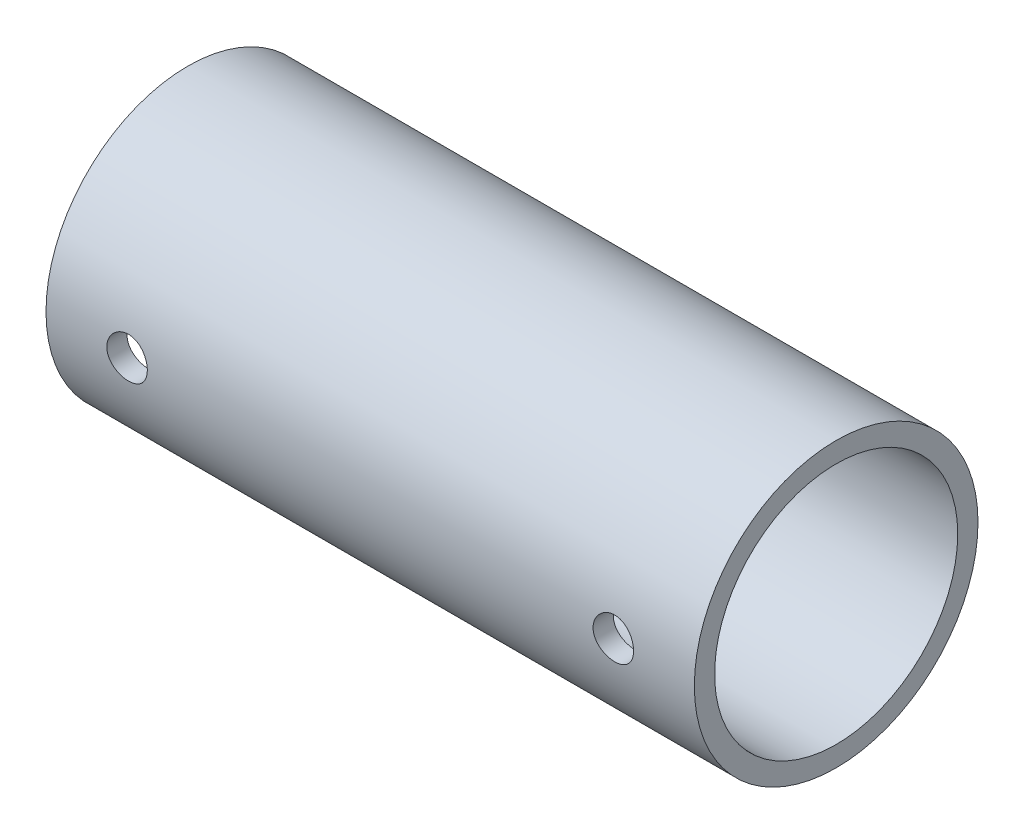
ISO-10303-21;
HEADER;
FILE_DESCRIPTION(('STEP AP214'),'2;1');
FILE_NAME('part.step','',(''),(''),'','','');
FILE_SCHEMA(('AUTOMOTIVE_DESIGN { 1 0 10303 214 1 1 1 1 }'));
ENDSEC;
DATA;
#1=APPLICATION_CONTEXT('core data for automotive mechanical design processes');
#2=APPLICATION_PROTOCOL_DEFINITION('international standard','automotive_design',2000,#1);
#3=PRODUCT_CONTEXT('',#1,'mechanical');
#4=PRODUCT('Part','Part','',(#3));
#5=PRODUCT_RELATED_PRODUCT_CATEGORY('part','',(#4));
#6=PRODUCT_DEFINITION_FORMATION('','',#4);
#7=PRODUCT_DEFINITION_CONTEXT('part definition',#1,'design');
#8=PRODUCT_DEFINITION('design','',#6,#7);
#9=PRODUCT_DEFINITION_SHAPE('','',#8);
#10=(LENGTH_UNIT() NAMED_UNIT(*) SI_UNIT(.MILLI.,.METRE.));
#11=(NAMED_UNIT(*) PLANE_ANGLE_UNIT() SI_UNIT($,.RADIAN.));
#12=(NAMED_UNIT(*) SI_UNIT($,.STERADIAN.) SOLID_ANGLE_UNIT());
#13=UNCERTAINTY_MEASURE_WITH_UNIT(LENGTH_MEASURE(1.E-05),#10,'distance_accuracy_value','');
#14=(GEOMETRIC_REPRESENTATION_CONTEXT(3) GLOBAL_UNCERTAINTY_ASSIGNED_CONTEXT((#13)) GLOBAL_UNIT_ASSIGNED_CONTEXT((#10,
#11,#12)) REPRESENTATION_CONTEXT('',''));
#15=CARTESIAN_POINT('',(0.,0.,0.));
#16=DIRECTION('',(0.,0.,1.));
#17=DIRECTION('',(1.,0.,0.));
#18=AXIS2_PLACEMENT_3D('',#15,#16,#17);
#19=CARTESIAN_POINT('',(203.2,0.,0.));
#20=DIRECTION('',(-1.,0.,0.));
#21=DIRECTION('',(0.,0.,1.));
#22=AXIS2_PLACEMENT_3D('',#19,#20,#21);
#23=CYLINDRICAL_SURFACE('',#22,38.1);
#24=CARTESIAN_POINT('',(184.15,0.,38.1));
#25=CARTESIAN_POINT('',(184.150002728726,-0.177087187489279,38.1000011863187));
#26=CARTESIAN_POINT('',(184.142589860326,-0.354137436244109,38.0987630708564));
#27=CARTESIAN_POINT('',(184.112999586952,-0.707020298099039,38.0938477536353));
#28=CARTESIAN_POINT('',(184.090819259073,-0.88285266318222,38.0901700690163));
#29=CARTESIAN_POINT('',(184.031840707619,-1.23209116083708,38.0804739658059));
#30=CARTESIAN_POINT('',(183.995033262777,-1.40549569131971,38.0744540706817));
#31=CARTESIAN_POINT('',(183.907066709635,-1.74860263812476,38.0602401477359));
#32=CARTESIAN_POINT('',(183.855902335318,-1.91830367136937,38.0520453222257));
#33=CARTESIAN_POINT('',(183.739682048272,-2.25254220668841,38.0337223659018));
#34=CARTESIAN_POINT('',(183.674642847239,-2.41708564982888,38.0235965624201));
#35=CARTESIAN_POINT('',(183.531088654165,-2.74014193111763,38.0016821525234));
#36=CARTESIAN_POINT('',(183.452568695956,-2.89865252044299,37.98989293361));
#37=CARTESIAN_POINT('',(183.282677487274,-3.20841653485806,37.9649864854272));
#38=CARTESIAN_POINT('',(183.191312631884,-3.35967352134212,37.9518699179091));
#39=CARTESIAN_POINT('',(182.996310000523,-3.65404496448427,37.9246597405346));
#40=CARTESIAN_POINT('',(182.892667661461,-3.79715636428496,37.9105657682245));
#41=CARTESIAN_POINT('',(182.672957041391,-4.07534808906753,37.8816744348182));
#42=CARTESIAN_POINT('',(182.55679392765,-4.21035302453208,37.8668722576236));
#43=CARTESIAN_POINT('',(182.313509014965,-4.4701701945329,37.8370808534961));
#44=CARTESIAN_POINT('',(182.186383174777,-4.59497863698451,37.822091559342));
#45=CARTESIAN_POINT('',(181.922122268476,-4.83345363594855,37.7923559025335));
#46=CARTESIAN_POINT('',(181.784990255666,-4.94712356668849,37.7776094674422));
#47=CARTESIAN_POINT('',(181.501568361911,-5.16261513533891,37.7487646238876));
#48=CARTESIAN_POINT('',(181.355275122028,-5.26443238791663,37.7346664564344));
#49=CARTESIAN_POINT('',(181.053703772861,-5.45600638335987,37.7074450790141));
#50=CARTESIAN_POINT('',(180.898378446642,-5.54568970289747,37.6943280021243));
#51=CARTESIAN_POINT('',(180.580551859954,-5.71167137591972,37.6695348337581));
#52=CARTESIAN_POINT('',(180.418047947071,-5.78796472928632,37.6578592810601));
#53=CARTESIAN_POINT('',(180.087118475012,-5.92652810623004,37.6363015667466));
#54=CARTESIAN_POINT('',(179.918695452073,-5.9888040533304,37.6264186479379));
#55=CARTESIAN_POINT('',(179.577069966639,-6.09891747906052,37.6087259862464));
#56=CARTESIAN_POINT('',(179.403865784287,-6.14674968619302,37.600917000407));
#57=CARTESIAN_POINT('',(178.882292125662,-6.26716384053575,37.581106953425));
#58=CARTESIAN_POINT('',(178.52851154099,-6.31810213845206,37.5724910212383));
#59=CARTESIAN_POINT('',(177.817521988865,-6.35996687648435,37.5654259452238));
#60=CARTESIAN_POINT('',(177.460313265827,-6.35089756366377,37.5669760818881));
#61=CARTESIAN_POINT('',(176.756257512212,-6.27352869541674,37.5799723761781));
#62=CARTESIAN_POINT('',(176.409341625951,-6.20584069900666,37.5913163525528));
#63=CARTESIAN_POINT('',(175.731874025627,-6.01409427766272,37.6224668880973));
#64=CARTESIAN_POINT('',(175.401322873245,-5.89003391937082,37.6422737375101));
#65=CARTESIAN_POINT('',(174.764119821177,-5.58844985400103,37.6882274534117));
#66=CARTESIAN_POINT('',(174.457590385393,-5.41067212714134,37.7144043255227));
#67=CARTESIAN_POINT('',(173.878482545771,-5.00687861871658,37.7701281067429));
#68=CARTESIAN_POINT('',(173.605906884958,-4.78085894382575,37.7996752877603));
#69=CARTESIAN_POINT('',(173.098901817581,-4.28366479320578,37.8592595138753));
#70=CARTESIAN_POINT('',(172.86498698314,-4.01196546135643,37.8892980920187));
#71=CARTESIAN_POINT('',(172.445990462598,-3.43289953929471,37.946142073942));
#72=CARTESIAN_POINT('',(172.260909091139,-3.12553271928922,37.9729474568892));
#73=CARTESIAN_POINT('',(171.944786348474,-2.48337302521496,38.0203428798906));
#74=CARTESIAN_POINT('',(171.813790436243,-2.14855736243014,38.0409276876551));
#75=CARTESIAN_POINT('',(171.610034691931,-1.46125779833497,38.0735205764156));
#76=CARTESIAN_POINT('',(171.53726998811,-1.10877537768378,38.0855293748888));
#77=CARTESIAN_POINT('',(171.452739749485,-0.400583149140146,38.0995206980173));
#78=CARTESIAN_POINT('',(171.440267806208,-0.0449598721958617,38.1016193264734));
#79=CARTESIAN_POINT('',(171.474793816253,0.663295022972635,38.0958718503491));
#80=CARTESIAN_POINT('',(171.521789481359,1.015926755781,38.0880261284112));
#81=CARTESIAN_POINT('',(171.673329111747,1.70600668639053,38.063343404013));
#82=CARTESIAN_POINT('',(171.777523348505,2.0435338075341,38.0465610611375));
#83=CARTESIAN_POINT('',(172.040129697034,2.6963290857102,38.0058793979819));
#84=CARTESIAN_POINT('',(172.198544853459,3.01159599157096,37.9819796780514));
#85=CARTESIAN_POINT('',(172.566713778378,3.61398995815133,37.9294267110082));
#86=CARTESIAN_POINT('',(172.77690880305,3.90084376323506,37.9007333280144));
#87=CARTESIAN_POINT('',(173.242065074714,4.43545868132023,37.8418970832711));
#88=CARTESIAN_POINT('',(173.497029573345,4.68321695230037,37.8117541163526));
#89=CARTESIAN_POINT('',(174.047650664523,5.13522675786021,37.7530404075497));
#90=CARTESIAN_POINT('',(174.343701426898,5.33900101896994,37.7244891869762));
#91=CARTESIAN_POINT('',(174.966260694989,5.69392350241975,37.6725570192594));
#92=CARTESIAN_POINT('',(175.292768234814,5.8450733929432,37.6491759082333));
#93=CARTESIAN_POINT('',(175.965570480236,6.08974872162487,37.6103751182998));
#94=CARTESIAN_POINT('',(176.311777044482,6.18351170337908,37.5949226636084));
#95=CARTESIAN_POINT('',(177.015502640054,6.31147698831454,37.5736562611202));
#96=CARTESIAN_POINT('',(177.373020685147,6.34568446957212,37.5678414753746));
#97=CARTESIAN_POINT('',(177.907200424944,6.35156479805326,37.566839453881));
#98=CARTESIAN_POINT('',(178.083891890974,6.34611349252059,37.5677648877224));
#99=CARTESIAN_POINT('',(178.436158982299,6.32051614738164,37.5720813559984));
#100=CARTESIAN_POINT('',(178.611735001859,6.30037562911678,37.5754714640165));
#101=CARTESIAN_POINT('',(178.960586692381,6.24553793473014,37.5846246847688));
#102=CARTESIAN_POINT('',(179.133861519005,6.21083556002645,37.5903886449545));
#103=CARTESIAN_POINT('',(179.476776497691,6.1271569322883,37.604118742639));
#104=CARTESIAN_POINT('',(179.646417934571,6.07818581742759,37.6120840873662));
#105=CARTESIAN_POINT('',(179.980804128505,5.96637654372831,37.6299820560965));
#106=CARTESIAN_POINT('',(180.145552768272,5.90354973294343,37.6399130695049));
#107=CARTESIAN_POINT('',(180.469106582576,5.76449173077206,37.6614601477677));
#108=CARTESIAN_POINT('',(180.627913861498,5.68826534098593,37.6730756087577));
#109=CARTESIAN_POINT('',(180.938629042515,5.52290613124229,37.6976722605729));
#110=CARTESIAN_POINT('',(181.090534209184,5.4337682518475,37.7106539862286));
#111=CARTESIAN_POINT('',(181.386304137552,5.24326758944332,37.7376124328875));
#112=CARTESIAN_POINT('',(181.530171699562,5.14190910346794,37.7515888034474));
#113=CARTESIAN_POINT('',(181.810671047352,4.92632600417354,37.7803292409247));
#114=CARTESIAN_POINT('',(181.947192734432,4.81195911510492,37.7951008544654));
#115=CARTESIAN_POINT('',(182.210092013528,4.5722232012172,37.824851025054));
#116=CARTESIAN_POINT('',(182.336473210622,4.44685811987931,37.8398295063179));
#117=CARTESIAN_POINT('',(182.578352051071,4.18587205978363,37.869588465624));
#118=CARTESIAN_POINT('',(182.69384315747,4.0502450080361,37.8843688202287));
#119=CARTESIAN_POINT('',(182.913014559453,3.76978048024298,37.9133039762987));
#120=CARTESIAN_POINT('',(183.016699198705,3.62494642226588,37.9274590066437));
#121=CARTESIAN_POINT('',(183.212289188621,3.32592456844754,37.9548537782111));
#122=CARTESIAN_POINT('',(183.304103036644,3.17167621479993,37.9680860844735));
#123=CARTESIAN_POINT('',(183.474355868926,2.85593164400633,37.9931404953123));
#124=CARTESIAN_POINT('',(183.552799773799,2.69443812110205,38.0049631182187));
#125=CARTESIAN_POINT('',(183.69572189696,2.36539813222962,38.026859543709));
#126=CARTESIAN_POINT('',(183.760209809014,2.19785596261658,38.0369345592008));
#127=CARTESIAN_POINT('',(183.874784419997,1.85787010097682,38.05505638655));
#128=CARTESIAN_POINT('',(183.924874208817,1.68542746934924,38.0631036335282));
#129=CARTESIAN_POINT('',(184.028052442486,1.26427501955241,38.0798175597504));
#130=CARTESIAN_POINT('',(184.07372844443,1.01366559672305,38.0873506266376));
#131=CARTESIAN_POINT('',(184.134700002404,0.508678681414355,38.0974409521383));
#132=CARTESIAN_POINT('',(184.149996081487,0.254301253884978,38.0999982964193));
#133=CARTESIAN_POINT('',(184.15,0.,38.1));
#134=B_SPLINE_CURVE_WITH_KNOTS('',3,(#24,#25,#26,#27,#28,#29,#30,#31,#32,#33,#34,#35,#36,#37,
#38,#39,#40,#41,#42,#43,#44,#45,#46,#47,#48,#49,#50,#51,#52,#53,#54,#55,#56,#57,#58,#59,#60,#61,
#62,#63,#64,#65,#66,#67,#68,#69,#70,#71,#72,#73,#74,#75,#76,#77,#78,#79,#80,#81,#82,#83,#84,#85,
#86,#87,#88,#89,#90,#91,#92,#93,#94,#95,#96,#97,#98,#99,#100,#101,#102,#103,#104,#105,#106,#107,
#108,#109,#110,#111,#112,#113,#114,#115,#116,#117,#118,#119,#120,#121,#122,#123,#124,#125,#126,
#127,#128,#129,#130,#131,#132,#133),.UNSPECIFIED.,.T.,.F.,(4,2,2,2,2,2,2,2,2,2,2,2,2,2,2,2,2,2,
2,2,2,2,2,2,2,2,2,2,2,2,2,2,2,2,2,2,2,2,2,2,2,2,2,2,2,2,2,2,2,2,2,2,2,2,4),(0.,
0.531038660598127,1.06218246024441,1.59366163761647,2.12533601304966,2.65637358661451,
3.1876072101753,3.71857727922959,4.24974531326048,4.78526441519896,5.32098177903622,
5.85653635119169,6.39228844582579,6.93114981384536,7.47021197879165,8.00904591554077,
8.54807627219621,9.61504645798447,10.6819411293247,11.7378373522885,12.7937697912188,
13.8547758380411,14.9158675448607,15.9901084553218,17.0643562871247,18.1395051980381,
19.2145641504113,20.2769963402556,21.339387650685,22.3953543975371,23.4513804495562,
24.5167374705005,25.5821719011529,26.6586431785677,27.7350803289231,28.807031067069,
29.8788885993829,30.4087059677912,30.9383242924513,31.4681318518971,31.9977488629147,
32.5269337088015,33.0559293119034,33.5851327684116,34.1141506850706,34.6496427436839,
35.1849435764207,35.720563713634,36.2559861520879,36.7953167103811,37.3344483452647,
37.8732042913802,38.4118445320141,39.1744413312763,39.9370250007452),.UNSPECIFIED.);
#135=CARTESIAN_POINT('',(184.15,0.,38.1));
#136=VERTEX_POINT('',#135);
#137=EDGE_CURVE('E82',#136,#136,#134,.T.);
#138=ORIENTED_EDGE('',*,*,#137,.F.);
#139=EDGE_LOOP('',(#138));
#140=FACE_BOUND('',#139,.T.);
#141=CARTESIAN_POINT('',(31.75,0.,38.1));
#142=CARTESIAN_POINT('',(31.7500027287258,-0.177087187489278,38.1000011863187));
#143=CARTESIAN_POINT('',(31.7425898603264,-0.354137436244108,38.0987630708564));
#144=CARTESIAN_POINT('',(31.7129995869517,-0.707020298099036,38.0938477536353));
#145=CARTESIAN_POINT('',(31.6908192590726,-0.882852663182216,38.0901700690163));
#146=CARTESIAN_POINT('',(31.6318407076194,-1.23209116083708,38.0804739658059));
#147=CARTESIAN_POINT('',(31.595033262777,-1.40549569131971,38.0744540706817));
#148=CARTESIAN_POINT('',(31.5070667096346,-1.74860263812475,38.0602401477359));
#149=CARTESIAN_POINT('',(31.4559023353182,-1.91830367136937,38.0520453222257));
#150=CARTESIAN_POINT('',(31.3396820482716,-2.25254220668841,38.0337223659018));
#151=CARTESIAN_POINT('',(31.2746428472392,-2.41708564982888,38.0235965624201));
#152=CARTESIAN_POINT('',(31.131088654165,-2.74014193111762,38.0016821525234));
#153=CARTESIAN_POINT('',(31.0525686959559,-2.89865252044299,37.98989293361));
#154=CARTESIAN_POINT('',(30.8826774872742,-3.20841653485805,37.9649864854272));
#155=CARTESIAN_POINT('',(30.7913126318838,-3.35967352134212,37.9518699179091));
#156=CARTESIAN_POINT('',(30.596310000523,-3.65404496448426,37.9246597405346));
#157=CARTESIAN_POINT('',(30.4926676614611,-3.79715636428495,37.9105657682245));
#158=CARTESIAN_POINT('',(30.2729570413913,-4.07534808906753,37.8816744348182));
#159=CARTESIAN_POINT('',(30.1567939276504,-4.21035302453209,37.8668722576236));
#160=CARTESIAN_POINT('',(29.9135090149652,-4.47017019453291,37.8370808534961));
#161=CARTESIAN_POINT('',(29.786383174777,-4.59497863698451,37.822091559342));
#162=CARTESIAN_POINT('',(29.5221222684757,-4.83345363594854,37.7923559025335));
#163=CARTESIAN_POINT('',(29.3849902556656,-4.94712356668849,37.7776094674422));
#164=CARTESIAN_POINT('',(29.1015683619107,-5.16261513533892,37.7487646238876));
#165=CARTESIAN_POINT('',(28.9552751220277,-5.26443238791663,37.7346664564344));
#166=CARTESIAN_POINT('',(28.6537037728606,-5.45600638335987,37.7074450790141));
#167=CARTESIAN_POINT('',(28.4983784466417,-5.54568970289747,37.6943280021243));
#168=CARTESIAN_POINT('',(28.1805518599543,-5.71167137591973,37.6695348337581));
#169=CARTESIAN_POINT('',(28.0180479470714,-5.78796472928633,37.6578592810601));
#170=CARTESIAN_POINT('',(27.6871184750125,-5.92652810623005,37.6363015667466));
#171=CARTESIAN_POINT('',(27.5186954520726,-5.98880405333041,37.6264186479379));
#172=CARTESIAN_POINT('',(27.1770699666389,-6.09891747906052,37.6087259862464));
#173=CARTESIAN_POINT('',(27.0038657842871,-6.14674968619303,37.600917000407));
#174=CARTESIAN_POINT('',(26.4822921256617,-6.26716384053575,37.581106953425));
#175=CARTESIAN_POINT('',(26.1285115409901,-6.31810213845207,37.5724910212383));
#176=CARTESIAN_POINT('',(25.4175219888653,-6.35996687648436,37.5654259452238));
#177=CARTESIAN_POINT('',(25.0603132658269,-6.35089756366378,37.5669760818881));
#178=CARTESIAN_POINT('',(24.3562575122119,-6.27352869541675,37.5799723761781));
#179=CARTESIAN_POINT('',(24.0093416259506,-6.20584069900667,37.5913163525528));
#180=CARTESIAN_POINT('',(23.3318740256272,-6.01409427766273,37.6224668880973));
#181=CARTESIAN_POINT('',(23.0013228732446,-5.89003391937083,37.6422737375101));
#182=CARTESIAN_POINT('',(22.3641198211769,-5.58844985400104,37.6882274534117));
#183=CARTESIAN_POINT('',(22.0575903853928,-5.41067212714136,37.7144043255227));
#184=CARTESIAN_POINT('',(21.4784825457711,-5.0068786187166,37.7701281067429));
#185=CARTESIAN_POINT('',(21.2059068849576,-4.78085894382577,37.7996752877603));
#186=CARTESIAN_POINT('',(20.6989018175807,-4.2836647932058,37.8592595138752));
#187=CARTESIAN_POINT('',(20.46498698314,-4.01196546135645,37.8892980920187));
#188=CARTESIAN_POINT('',(20.0459904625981,-3.43289953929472,37.946142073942));
#189=CARTESIAN_POINT('',(19.8609090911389,-3.12553271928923,37.9729474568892));
#190=CARTESIAN_POINT('',(19.5447863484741,-2.48337302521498,38.0203428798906));
#191=CARTESIAN_POINT('',(19.4137904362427,-2.14855736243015,38.0409276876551));
#192=CARTESIAN_POINT('',(19.2100346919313,-1.46125779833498,38.0735205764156));
#193=CARTESIAN_POINT('',(19.1372699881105,-1.10877537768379,38.0855293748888));
#194=CARTESIAN_POINT('',(19.0527397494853,-0.400583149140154,38.0995206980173));
#195=CARTESIAN_POINT('',(19.040267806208,-0.0449598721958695,38.1016193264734));
#196=CARTESIAN_POINT('',(19.0747938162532,0.663295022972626,38.0958718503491));
#197=CARTESIAN_POINT('',(19.1217894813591,1.01592675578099,38.0880261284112));
#198=CARTESIAN_POINT('',(19.2733291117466,1.70600668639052,38.063343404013));
#199=CARTESIAN_POINT('',(19.3775233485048,2.0435338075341,38.0465610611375));
#200=CARTESIAN_POINT('',(19.6401296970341,2.6963290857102,38.0058793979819));
#201=CARTESIAN_POINT('',(19.7985448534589,3.01159599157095,37.9819796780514));
#202=CARTESIAN_POINT('',(20.1667137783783,3.61398995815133,37.9294267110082));
#203=CARTESIAN_POINT('',(20.3769088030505,3.90084376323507,37.9007333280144));
#204=CARTESIAN_POINT('',(20.8420650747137,4.43545868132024,37.8418970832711));
#205=CARTESIAN_POINT('',(21.0970295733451,4.68321695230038,37.8117541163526));
#206=CARTESIAN_POINT('',(21.6476506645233,5.13522675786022,37.7530404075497));
#207=CARTESIAN_POINT('',(21.943701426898,5.33900101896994,37.7244891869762));
#208=CARTESIAN_POINT('',(22.5662606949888,5.69392350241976,37.6725570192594));
#209=CARTESIAN_POINT('',(22.8927682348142,5.84507339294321,37.6491759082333));
#210=CARTESIAN_POINT('',(23.5655704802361,6.08974872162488,37.6103751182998));
#211=CARTESIAN_POINT('',(23.9117770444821,6.18351170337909,37.5949226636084));
#212=CARTESIAN_POINT('',(24.6155026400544,6.31147698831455,37.5736562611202));
#213=CARTESIAN_POINT('',(24.9730206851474,6.34568446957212,37.5678414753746));
#214=CARTESIAN_POINT('',(25.5072004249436,6.35156479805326,37.566839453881));
#215=CARTESIAN_POINT('',(25.6838918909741,6.3461134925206,37.5677648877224));
#216=CARTESIAN_POINT('',(26.036158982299,6.32051614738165,37.5720813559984));
#217=CARTESIAN_POINT('',(26.2117350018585,6.30037562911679,37.5754714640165));
#218=CARTESIAN_POINT('',(26.5605866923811,6.24553793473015,37.5846246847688));
#219=CARTESIAN_POINT('',(26.7338615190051,6.21083556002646,37.5903886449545));
#220=CARTESIAN_POINT('',(27.0767764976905,6.12715693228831,37.604118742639));
#221=CARTESIAN_POINT('',(27.2464179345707,6.0781858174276,37.6120840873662));
#222=CARTESIAN_POINT('',(27.5808041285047,5.96637654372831,37.6299820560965));
#223=CARTESIAN_POINT('',(27.7455527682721,5.90354973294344,37.6399130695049));
#224=CARTESIAN_POINT('',(28.0691065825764,5.76449173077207,37.6614601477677));
#225=CARTESIAN_POINT('',(28.227913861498,5.68826534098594,37.6730756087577));
#226=CARTESIAN_POINT('',(28.5386290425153,5.5229061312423,37.6976722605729));
#227=CARTESIAN_POINT('',(28.6905342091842,5.43376825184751,37.7106539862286));
#228=CARTESIAN_POINT('',(28.9863041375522,5.24326758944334,37.7376124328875));
#229=CARTESIAN_POINT('',(29.1301716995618,5.14190910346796,37.7515888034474));
#230=CARTESIAN_POINT('',(29.4106710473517,4.92632600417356,37.7803292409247));
#231=CARTESIAN_POINT('',(29.5471927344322,4.81195911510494,37.7951008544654));
#232=CARTESIAN_POINT('',(29.8100920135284,4.57222320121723,37.824851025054));
#233=CARTESIAN_POINT('',(29.9364732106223,4.44685811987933,37.8398295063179));
#234=CARTESIAN_POINT('',(30.1783520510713,4.18587205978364,37.869588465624));
#235=CARTESIAN_POINT('',(30.2938431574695,4.05024500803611,37.8843688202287));
#236=CARTESIAN_POINT('',(30.5130145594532,3.76978048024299,37.9133039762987));
#237=CARTESIAN_POINT('',(30.6166991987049,3.62494642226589,37.9274590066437));
#238=CARTESIAN_POINT('',(30.8122891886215,3.32592456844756,37.9548537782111));
#239=CARTESIAN_POINT('',(30.904103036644,3.17167621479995,37.9680860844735));
#240=CARTESIAN_POINT('',(31.0743558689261,2.85593164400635,37.9931404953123));
#241=CARTESIAN_POINT('',(31.152799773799,2.69443812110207,38.0049631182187));
#242=CARTESIAN_POINT('',(31.2957218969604,2.36539813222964,38.026859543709));
#243=CARTESIAN_POINT('',(31.3602098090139,2.19785596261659,38.0369345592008));
#244=CARTESIAN_POINT('',(31.4747844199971,1.85787010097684,38.05505638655));
#245=CARTESIAN_POINT('',(31.5248742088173,1.68542746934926,38.0631036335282));
#246=CARTESIAN_POINT('',(31.628052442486,1.26427501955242,38.0798175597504));
#247=CARTESIAN_POINT('',(31.6737284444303,1.01366559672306,38.0873506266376));
#248=CARTESIAN_POINT('',(31.7347000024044,0.508678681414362,38.0974409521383));
#249=CARTESIAN_POINT('',(31.7499960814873,0.254301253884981,38.0999982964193));
#250=CARTESIAN_POINT('',(31.75,0.,38.1));
#251=B_SPLINE_CURVE_WITH_KNOTS('',3,(#141,#142,#143,#144,#145,#146,#147,#148,#149,#150,#151,
#152,#153,#154,#155,#156,#157,#158,#159,#160,#161,#162,#163,#164,#165,#166,#167,#168,#169,#170,
#171,#172,#173,#174,#175,#176,#177,#178,#179,#180,#181,#182,#183,#184,#185,#186,#187,#188,#189,
#190,#191,#192,#193,#194,#195,#196,#197,#198,#199,#200,#201,#202,#203,#204,#205,#206,#207,#208,
#209,#210,#211,#212,#213,#214,#215,#216,#217,#218,#219,#220,#221,#222,#223,#224,#225,#226,#227,
#228,#229,#230,#231,#232,#233,#234,#235,#236,#237,#238,#239,#240,#241,#242,#243,#244,#245,#246,
#247,#248,#249,#250),.UNSPECIFIED.,.T.,.F.,(4,2,2,2,2,2,2,2,2,2,2,2,2,2,2,2,2,2,2,2,2,2,2,2,2,2,
2,2,2,2,2,2,2,2,2,2,2,2,2,2,2,2,2,2,2,2,2,2,2,2,2,2,2,2,4),(0.,0.531038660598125,
1.06218246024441,1.59366163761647,2.12533601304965,2.6563735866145,3.1876072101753,
3.71857727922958,4.24974531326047,4.78526441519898,5.3209817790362,5.85653635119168,
6.3922884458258,6.93114981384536,7.47021197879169,8.00904591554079,8.54807627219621,
9.61504645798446,10.6819411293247,11.7378373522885,12.7937697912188,13.8547758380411,
14.9158675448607,15.9901084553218,17.0643562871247,18.1395051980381,19.2145641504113,
20.2769963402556,21.339387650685,22.3953543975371,23.4513804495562,24.5167374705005,
25.5821719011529,26.6586431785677,27.7350803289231,28.807031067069,29.8788885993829,
30.4087059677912,30.9383242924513,31.4681318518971,31.9977488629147,32.5269337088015,
33.0559293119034,33.5851327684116,34.1141506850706,34.6496427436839,35.1849435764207,
35.720563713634,36.2559861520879,36.7953167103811,37.3344483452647,37.8732042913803,
38.4118445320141,39.1744413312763,39.9370250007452),.UNSPECIFIED.);
#252=CARTESIAN_POINT('',(31.75,0.,38.1));
#253=VERTEX_POINT('',#252);
#254=EDGE_CURVE('E75',#253,#253,#251,.T.);
#255=ORIENTED_EDGE('',*,*,#254,.F.);
#256=EDGE_LOOP('',(#255));
#257=FACE_BOUND('',#256,.T.);
#258=CARTESIAN_POINT('',(203.2,0.,0.));
#259=DIRECTION('',(1.,0.,0.));
#260=DIRECTION('',(0.,0.,-1.));
#261=AXIS2_PLACEMENT_3D('',#258,#259,#260);
#262=CIRCLE('',#261,38.1);
#263=CARTESIAN_POINT('',(203.2,0.,-38.1));
#264=VERTEX_POINT('',#263);
#265=EDGE_CURVE('E53',#264,#264,#262,.T.);
#266=ORIENTED_EDGE('',*,*,#265,.T.);
#267=EDGE_LOOP('',(#266));
#268=FACE_BOUND('',#267,.T.);
#269=CARTESIAN_POINT('',(0.,0.,0.));
#270=DIRECTION('',(1.,0.,0.));
#271=DIRECTION('',(0.,0.,-1.));
#272=AXIS2_PLACEMENT_3D('',#269,#270,#271);
#273=CIRCLE('',#272,38.1);
#274=CARTESIAN_POINT('',(0.,0.,-38.1));
#275=VERTEX_POINT('',#274);
#276=EDGE_CURVE('E81',#275,#275,#273,.T.);
#277=ORIENTED_EDGE('',*,*,#276,.F.);
#278=EDGE_LOOP('',(#277));
#279=FACE_BOUND('',#278,.T.);
#280=ADVANCED_FACE('F35',(#140,#257,#268,#279),#23,.F.);
#281=CARTESIAN_POINT('',(203.2,0.,0.));
#282=DIRECTION('',(-1.,0.,0.));
#283=DIRECTION('',(0.,0.,1.));
#284=AXIS2_PLACEMENT_3D('',#281,#282,#283);
#285=CYLINDRICAL_SURFACE('',#284,44.45);
#286=CARTESIAN_POINT('',(184.15,0.,44.45));
#287=CARTESIAN_POINT('',(184.150002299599,-0.177434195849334,44.4500008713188));
#288=CARTESIAN_POINT('',(184.142560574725,-0.354835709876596,44.4489355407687));
#289=CARTESIAN_POINT('',(184.112852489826,-0.708423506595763,44.444705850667));
#290=CARTESIAN_POINT('',(184.090582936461,-0.884609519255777,44.4415410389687));
#291=CARTESIAN_POINT('',(184.031360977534,-1.23456971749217,44.4331971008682));
#292=CARTESIAN_POINT('',(183.994398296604,-1.4083421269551,44.4280165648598));
#293=CARTESIAN_POINT('',(183.906052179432,-1.75218284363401,44.4157850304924));
#294=CARTESIAN_POINT('',(183.854663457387,-1.92224976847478,44.4087333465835));
#295=CARTESIAN_POINT('',(183.737916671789,-2.25722650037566,44.3929669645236));
#296=CARTESIAN_POINT('',(183.672574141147,-2.42214180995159,44.3842541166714));
#297=CARTESIAN_POINT('',(183.528335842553,-2.74592238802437,44.3654000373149));
#298=CARTESIAN_POINT('',(183.449435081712,-2.9047854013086,44.3552582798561));
#299=CARTESIAN_POINT('',(183.278708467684,-3.2152163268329,44.3338367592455));
#300=CARTESIAN_POINT('',(183.186889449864,-3.3667880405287,44.3225575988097));
#301=CARTESIAN_POINT('',(182.990906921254,-3.66174124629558,44.2991653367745));
#302=CARTESIAN_POINT('',(182.886738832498,-3.8051196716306,44.2870519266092));
#303=CARTESIAN_POINT('',(182.666151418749,-4.08347822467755,44.2622565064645));
#304=CARTESIAN_POINT('',(182.549662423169,-4.21840288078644,44.2495715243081));
#305=CARTESIAN_POINT('',(182.305720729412,-4.47802642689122,44.2240523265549));
#306=CARTESIAN_POINT('',(182.178263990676,-4.60272151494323,44.211218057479));
#307=CARTESIAN_POINT('',(181.913348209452,-4.84092832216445,44.1857698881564));
#308=CARTESIAN_POINT('',(181.775892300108,-4.95444351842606,44.1731559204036));
#309=CARTESIAN_POINT('',(181.491840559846,-5.16958101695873,44.1484955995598));
#310=CARTESIAN_POINT('',(181.345241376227,-5.27119891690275,44.1364494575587));
#311=CARTESIAN_POINT('',(181.043345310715,-5.46216454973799,44.1132242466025));
#312=CARTESIAN_POINT('',(180.888015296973,-5.55146037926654,44.1020489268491));
#313=CARTESIAN_POINT('',(180.570243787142,-5.71667169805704,44.0809380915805));
#314=CARTESIAN_POINT('',(180.407799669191,-5.79258220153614,44.0710030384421));
#315=CARTESIAN_POINT('',(180.077053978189,-5.93039544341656,44.0526702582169));
#316=CARTESIAN_POINT('',(179.908754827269,-5.99230389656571,44.0442719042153));
#317=CARTESIAN_POINT('',(179.56744019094,-6.10170752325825,44.0292478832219));
#318=CARTESIAN_POINT('',(179.394423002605,-6.14919741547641,44.0226228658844));
#319=CARTESIAN_POINT('',(178.872653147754,-6.26883811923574,44.0058063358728));
#320=CARTESIAN_POINT('',(178.518539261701,-6.31925721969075,43.9985222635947));
#321=CARTESIAN_POINT('',(177.807001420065,-6.36000106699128,43.9926500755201));
#322=CARTESIAN_POINT('',(177.449577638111,-6.35032894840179,43.9940615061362));
#323=CARTESIAN_POINT('',(176.744158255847,-6.27157381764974,44.0053565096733));
#324=CARTESIAN_POINT('',(176.396112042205,-6.20293703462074,44.0151764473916));
#325=CARTESIAN_POINT('',(175.716541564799,-6.00887753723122,44.0420866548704));
#326=CARTESIAN_POINT('',(175.385017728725,-5.88345335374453,44.0591771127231));
#327=CARTESIAN_POINT('',(174.746519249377,-5.57891611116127,44.0987725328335));
#328=CARTESIAN_POINT('',(174.439636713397,-5.3996125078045,44.1212966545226));
#329=CARTESIAN_POINT('',(173.860147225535,-4.99254056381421,44.1692076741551));
#330=CARTESIAN_POINT('',(173.587542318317,-4.76476933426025,44.1945947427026));
#331=CARTESIAN_POINT('',(173.081757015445,-4.26477083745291,44.2456529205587));
#332=CARTESIAN_POINT('',(172.848956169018,-3.99215950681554,44.2713245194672));
#333=CARTESIAN_POINT('',(172.432354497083,-3.41153216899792,44.3198451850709));
#334=CARTESIAN_POINT('',(172.248553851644,-3.10351603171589,44.3426942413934));
#335=CARTESIAN_POINT('',(171.935156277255,-2.46050460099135,44.3830160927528));
#336=CARTESIAN_POINT('',(171.805586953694,-2.12549567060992,44.4004861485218));
#337=CARTESIAN_POINT('',(171.604651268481,-1.43816926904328,44.4280582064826));
#338=CARTESIAN_POINT('',(171.53328134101,-1.08585285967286,44.4381606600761));
#339=CARTESIAN_POINT('',(171.451271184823,-0.377190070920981,44.4497998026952));
#340=CARTESIAN_POINT('',(171.44010883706,-0.0209052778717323,44.4514101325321));
#341=CARTESIAN_POINT('',(171.477447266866,0.688450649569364,44.4460835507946));
#342=CARTESIAN_POINT('',(171.525946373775,1.04152187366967,44.4391468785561));
#343=CARTESIAN_POINT('',(171.680796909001,1.73285917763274,44.4175513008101));
#344=CARTESIAN_POINT('',(171.786895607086,2.07118301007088,44.4029261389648));
#345=CARTESIAN_POINT('',(172.053668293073,2.72523884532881,44.3675888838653));
#346=CARTESIAN_POINT('',(172.214344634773,3.04096987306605,44.3468765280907));
#347=CARTESIAN_POINT('',(172.58694779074,3.64318454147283,44.3014854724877));
#348=CARTESIAN_POINT('',(172.799207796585,3.92946007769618,44.2767813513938));
#349=CARTESIAN_POINT('',(173.268488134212,4.46251103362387,44.2262401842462));
#350=CARTESIAN_POINT('',(173.525510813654,4.70928438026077,44.2004030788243));
#351=CARTESIAN_POINT('',(174.079332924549,5.15821192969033,44.1502761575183));
#352=CARTESIAN_POINT('',(174.376416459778,5.36001729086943,44.1259994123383));
#353=CARTESIAN_POINT('',(175.00058499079,5.71085842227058,44.081969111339));
#354=CARTESIAN_POINT('',(175.327669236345,5.8598955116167,44.0622154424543));
#355=CARTESIAN_POINT('',(176.001421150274,6.10042772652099,44.0295586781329));
#356=CARTESIAN_POINT('',(176.348020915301,6.19211037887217,44.0166332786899));
#357=CARTESIAN_POINT('',(177.052092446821,6.31590700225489,43.9990443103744));
#358=CARTESIAN_POINT('',(177.409563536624,6.34802467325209,43.994380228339));
#359=CARTESIAN_POINT('',(177.94401368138,6.35085004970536,43.9939655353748));
#360=CARTESIAN_POINT('',(178.121154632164,6.34435041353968,43.9949072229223));
#361=CARTESIAN_POINT('',(178.474233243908,6.31658174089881,43.9989039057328));
#362=CARTESIAN_POINT('',(178.650171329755,6.29531822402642,44.0019581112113));
#363=CARTESIAN_POINT('',(178.999659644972,6.23816465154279,44.0100967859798));
#364=CARTESIAN_POINT('',(179.173208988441,6.20226931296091,44.0151819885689));
#365=CARTESIAN_POINT('',(179.516581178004,6.11613954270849,44.0272328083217));
#366=CARTESIAN_POINT('',(179.686405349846,6.0659103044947,44.0341977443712));
#367=CARTESIAN_POINT('',(180.021151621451,5.95149273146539,44.0498077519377));
#368=CARTESIAN_POINT('',(180.186075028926,5.88730815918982,44.0584523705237));
#369=CARTESIAN_POINT('',(180.509865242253,5.74546419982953,44.077173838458));
#370=CARTESIAN_POINT('',(180.6687342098,5.66780967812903,44.0872501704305));
#371=CARTESIAN_POINT('',(180.97944477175,5.49953248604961,44.1085573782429));
#372=CARTESIAN_POINT('',(181.131283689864,5.40890492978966,44.119788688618));
#373=CARTESIAN_POINT('',(181.426780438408,5.21537592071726,44.1430837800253));
#374=CARTESIAN_POINT('',(181.57044115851,5.11247884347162,44.1551472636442));
#375=CARTESIAN_POINT('',(181.849931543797,4.89410765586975,44.1798867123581));
#376=CARTESIAN_POINT('',(181.985678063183,4.77852762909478,44.1925672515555));
#377=CARTESIAN_POINT('',(182.246921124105,4.53641903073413,44.2180755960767));
#378=CARTESIAN_POINT('',(182.372421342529,4.40989442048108,44.230903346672));
#379=CARTESIAN_POINT('',(182.612429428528,4.14665722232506,44.2563580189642));
#380=CARTESIAN_POINT('',(182.726930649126,4.0099385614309,44.2689848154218));
#381=CARTESIAN_POINT('',(182.944014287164,3.72737803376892,44.2936705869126));
#382=CARTESIAN_POINT('',(183.04660109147,3.58153955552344,44.3057297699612));
#383=CARTESIAN_POINT('',(183.23969630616,3.28089797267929,44.3290091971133));
#384=CARTESIAN_POINT('',(183.330137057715,3.12605102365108,44.3402246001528));
#385=CARTESIAN_POINT('',(183.497601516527,2.80925743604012,44.3614220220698));
#386=CARTESIAN_POINT('',(183.574630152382,2.64731343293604,44.3714044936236));
#387=CARTESIAN_POINT('',(183.714692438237,2.31753675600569,44.3898497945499));
#388=CARTESIAN_POINT('',(183.777736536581,2.14970858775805,44.3983137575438));
#389=CARTESIAN_POINT('',(183.889416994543,1.80930715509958,44.4134883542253));
#390=CARTESIAN_POINT('',(183.938056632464,1.63673498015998,44.4201993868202));
#391=CARTESIAN_POINT('',(184.035927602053,1.22314791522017,44.4338113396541));
#392=CARTESIAN_POINT('',(184.078658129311,0.980536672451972,44.4398555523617));
#393=CARTESIAN_POINT('',(184.135692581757,0.491929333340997,44.4479492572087));
#394=CARTESIAN_POINT('',(184.149996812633,0.245933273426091,44.4499987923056));
#395=CARTESIAN_POINT('',(184.15,0.,44.45));
#396=B_SPLINE_CURVE_WITH_KNOTS('',3,(#286,#287,#288,#289,#290,#291,#292,#293,#294,#295,#296,
#297,#298,#299,#300,#301,#302,#303,#304,#305,#306,#307,#308,#309,#310,#311,#312,#313,#314,#315,
#316,#317,#318,#319,#320,#321,#322,#323,#324,#325,#326,#327,#328,#329,#330,#331,#332,#333,#334,
#335,#336,#337,#338,#339,#340,#341,#342,#343,#344,#345,#346,#347,#348,#349,#350,#351,#352,#353,
#354,#355,#356,#357,#358,#359,#360,#361,#362,#363,#364,#365,#366,#367,#368,#369,#370,#371,#372,
#373,#374,#375,#376,#377,#378,#379,#380,#381,#382,#383,#384,#385,#386,#387,#388,#389,#390,#391,
#392,#393,#394,#395),.UNSPECIFIED.,.T.,.F.,(4,2,2,2,2,2,2,2,2,2,2,2,2,2,2,2,2,2,2,2,2,2,2,2,2,2,
2,2,2,2,2,2,2,2,2,2,2,2,2,2,2,2,2,2,2,2,2,2,2,2,2,2,2,2,4),(0.,0.53208723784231,
1.06428910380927,1.59686381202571,2.12963391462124,2.66181401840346,3.1941905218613,
3.72628638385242,4.2585801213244,4.79406342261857,5.32974484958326,5.86525914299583,
6.40097096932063,6.93887461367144,7.47697819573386,8.01486176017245,8.55294210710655,
9.62061615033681,10.6882345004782,11.7478438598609,12.8074806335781,13.8709098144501,
14.9344023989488,16.0075299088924,17.0806613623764,18.154338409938,19.2279496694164,
20.292235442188,21.3564914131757,22.4161150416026,23.4757843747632,24.5424893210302,
25.6092502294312,26.6840188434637,27.7587605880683,28.8299697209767,29.9011123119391,
30.4323828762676,30.9634549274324,31.4947188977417,32.0257906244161,32.5567193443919,
33.0874566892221,33.6183944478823,34.1491434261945,34.6847215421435,35.2201066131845,
35.755813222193,36.2913219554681,36.8296998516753,37.3678794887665,37.9056556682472,
38.4433093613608,39.1808186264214,39.9183199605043),.UNSPECIFIED.);
#397=CARTESIAN_POINT('',(184.15,0.,44.45));
#398=VERTEX_POINT('',#397);
#399=EDGE_CURVE('E10',#398,#398,#396,.T.);
#400=ORIENTED_EDGE('',*,*,#399,.T.);
#401=EDGE_LOOP('',(#400));
#402=FACE_BOUND('',#401,.T.);
#403=CARTESIAN_POINT('',(31.75,0.,44.45));
#404=CARTESIAN_POINT('',(31.7500022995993,-0.177434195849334,44.4500008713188));
#405=CARTESIAN_POINT('',(31.7425605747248,-0.354835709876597,44.4489355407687));
#406=CARTESIAN_POINT('',(31.7128524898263,-0.708423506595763,44.444705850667));
#407=CARTESIAN_POINT('',(31.6905829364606,-0.884609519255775,44.4415410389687));
#408=CARTESIAN_POINT('',(31.6313609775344,-1.23456971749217,44.4331971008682));
#409=CARTESIAN_POINT('',(31.5943982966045,-1.4083421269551,44.4280165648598));
#410=CARTESIAN_POINT('',(31.5060521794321,-1.75218284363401,44.4157850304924));
#411=CARTESIAN_POINT('',(31.4546634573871,-1.92224976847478,44.4087333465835));
#412=CARTESIAN_POINT('',(31.3379166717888,-2.25722650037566,44.3929669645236));
#413=CARTESIAN_POINT('',(31.2725741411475,-2.42214180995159,44.3842541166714));
#414=CARTESIAN_POINT('',(31.1283358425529,-2.74592238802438,44.3654000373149));
#415=CARTESIAN_POINT('',(31.0494350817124,-2.9047854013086,44.3552582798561));
#416=CARTESIAN_POINT('',(30.8787084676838,-3.2152163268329,44.3338367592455));
#417=CARTESIAN_POINT('',(30.7868894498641,-3.3667880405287,44.3225575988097));
#418=CARTESIAN_POINT('',(30.5909069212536,-3.66174124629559,44.2991653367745));
#419=CARTESIAN_POINT('',(30.4867388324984,-3.80511967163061,44.2870519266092));
#420=CARTESIAN_POINT('',(30.2661514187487,-4.08347822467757,44.2622565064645));
#421=CARTESIAN_POINT('',(30.1496624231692,-4.21840288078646,44.2495715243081));
#422=CARTESIAN_POINT('',(29.9057207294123,-4.47802642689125,44.2240523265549));
#423=CARTESIAN_POINT('',(29.7782639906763,-4.60272151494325,44.211218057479));
#424=CARTESIAN_POINT('',(29.5133482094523,-4.84092832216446,44.1857698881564));
#425=CARTESIAN_POINT('',(29.3758923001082,-4.95444351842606,44.1731559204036));
#426=CARTESIAN_POINT('',(29.0918405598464,-5.16958101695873,44.1484955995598));
#427=CARTESIAN_POINT('',(28.9452413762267,-5.27119891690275,44.1364494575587));
#428=CARTESIAN_POINT('',(28.6433453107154,-5.46216454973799,44.1132242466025));
#429=CARTESIAN_POINT('',(28.4880152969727,-5.55146037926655,44.1020489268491));
#430=CARTESIAN_POINT('',(28.1702437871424,-5.71667169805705,44.0809380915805));
#431=CARTESIAN_POINT('',(28.0077996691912,-5.79258220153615,44.0710030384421));
#432=CARTESIAN_POINT('',(27.6770539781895,-5.93039544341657,44.0526702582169));
#433=CARTESIAN_POINT('',(27.5087548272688,-5.99230389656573,44.0442719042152));
#434=CARTESIAN_POINT('',(27.1674401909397,-6.10170752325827,44.0292478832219));
#435=CARTESIAN_POINT('',(26.9944230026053,-6.14919741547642,44.0226228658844));
#436=CARTESIAN_POINT('',(26.4726531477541,-6.26883811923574,44.0058063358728));
#437=CARTESIAN_POINT('',(26.1185392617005,-6.31925721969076,43.9985222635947));
#438=CARTESIAN_POINT('',(25.4070014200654,-6.36000106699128,43.9926500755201));
#439=CARTESIAN_POINT('',(25.0495776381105,-6.3503289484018,43.9940615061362));
#440=CARTESIAN_POINT('',(24.3441582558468,-6.27157381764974,44.0053565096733));
#441=CARTESIAN_POINT('',(23.9961120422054,-6.20293703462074,44.0151764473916));
#442=CARTESIAN_POINT('',(23.3165415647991,-6.00887753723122,44.0420866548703));
#443=CARTESIAN_POINT('',(22.9850177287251,-5.88345335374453,44.0591771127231));
#444=CARTESIAN_POINT('',(22.3465192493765,-5.57891611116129,44.0987725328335));
#445=CARTESIAN_POINT('',(22.0396367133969,-5.39961250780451,44.1212966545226));
#446=CARTESIAN_POINT('',(21.4601472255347,-4.99254056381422,44.1692076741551));
#447=CARTESIAN_POINT('',(21.1875423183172,-4.76476933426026,44.1945947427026));
#448=CARTESIAN_POINT('',(20.6817570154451,-4.26477083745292,44.2456529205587));
#449=CARTESIAN_POINT('',(20.4489561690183,-3.99215950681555,44.2713245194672));
#450=CARTESIAN_POINT('',(20.0323544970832,-3.41153216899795,44.3198451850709));
#451=CARTESIAN_POINT('',(19.8485538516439,-3.10351603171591,44.3426942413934));
#452=CARTESIAN_POINT('',(19.5351562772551,-2.46050460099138,44.3830160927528));
#453=CARTESIAN_POINT('',(19.4055869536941,-2.12549567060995,44.4004861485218));
#454=CARTESIAN_POINT('',(19.2046512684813,-1.4381692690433,44.4280582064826));
#455=CARTESIAN_POINT('',(19.1332813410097,-1.08585285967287,44.4381606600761));
#456=CARTESIAN_POINT('',(19.0512711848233,-0.377190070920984,44.4497998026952));
#457=CARTESIAN_POINT('',(19.0401088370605,-0.0209052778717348,44.4514101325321));
#458=CARTESIAN_POINT('',(19.0774472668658,0.688450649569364,44.4460835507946));
#459=CARTESIAN_POINT('',(19.1259463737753,1.04152187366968,44.4391468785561));
#460=CARTESIAN_POINT('',(19.2807969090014,1.73285917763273,44.4175513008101));
#461=CARTESIAN_POINT('',(19.3868956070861,2.07118301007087,44.4029261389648));
#462=CARTESIAN_POINT('',(19.6536682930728,2.7252388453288,44.3675888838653));
#463=CARTESIAN_POINT('',(19.8143446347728,3.04096987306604,44.3468765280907));
#464=CARTESIAN_POINT('',(20.1869477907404,3.64318454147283,44.3014854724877));
#465=CARTESIAN_POINT('',(20.3992077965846,3.92946007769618,44.2767813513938));
#466=CARTESIAN_POINT('',(20.8684881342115,4.46251103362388,44.2262401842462));
#467=CARTESIAN_POINT('',(21.1255108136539,4.70928438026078,44.2004030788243));
#468=CARTESIAN_POINT('',(21.6793329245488,5.15821192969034,44.1502761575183));
#469=CARTESIAN_POINT('',(21.9764164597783,5.36001729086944,44.1259994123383));
#470=CARTESIAN_POINT('',(22.6005849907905,5.71085842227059,44.081969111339));
#471=CARTESIAN_POINT('',(22.9276692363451,5.85989551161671,44.0622154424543));
#472=CARTESIAN_POINT('',(23.6014211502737,6.100427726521,44.0295586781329));
#473=CARTESIAN_POINT('',(23.9480209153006,6.19211037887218,44.0166332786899));
#474=CARTESIAN_POINT('',(24.6520924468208,6.3159070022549,43.9990443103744));
#475=CARTESIAN_POINT('',(25.0095635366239,6.3480246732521,43.994380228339));
#476=CARTESIAN_POINT('',(25.5440136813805,6.35085004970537,43.9939655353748));
#477=CARTESIAN_POINT('',(25.7211546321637,6.34435041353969,43.9949072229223));
#478=CARTESIAN_POINT('',(26.0742332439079,6.31658174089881,43.9989039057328));
#479=CARTESIAN_POINT('',(26.2501713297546,6.29531822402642,44.0019581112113));
#480=CARTESIAN_POINT('',(26.5996596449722,6.23816465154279,44.0100967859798));
#481=CARTESIAN_POINT('',(26.7732089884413,6.20226931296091,44.0151819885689));
#482=CARTESIAN_POINT('',(27.1165811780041,6.11613954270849,44.0272328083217));
#483=CARTESIAN_POINT('',(27.2864053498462,6.0659103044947,44.0341977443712));
#484=CARTESIAN_POINT('',(27.6211516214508,5.95149273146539,44.0498077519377));
#485=CARTESIAN_POINT('',(27.7860750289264,5.88730815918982,44.0584523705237));
#486=CARTESIAN_POINT('',(28.1098652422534,5.74546419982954,44.077173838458));
#487=CARTESIAN_POINT('',(28.2687342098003,5.66780967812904,44.0872501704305));
#488=CARTESIAN_POINT('',(28.5794447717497,5.49953248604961,44.1085573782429));
#489=CARTESIAN_POINT('',(28.7312836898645,5.40890492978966,44.119788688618));
#490=CARTESIAN_POINT('',(29.0267804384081,5.21537592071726,44.1430837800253));
#491=CARTESIAN_POINT('',(29.1704411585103,5.11247884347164,44.1551472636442));
#492=CARTESIAN_POINT('',(29.4499315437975,4.89410765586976,44.1798867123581));
#493=CARTESIAN_POINT('',(29.5856780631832,4.77852762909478,44.1925672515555));
#494=CARTESIAN_POINT('',(29.8469211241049,4.53641903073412,44.2180755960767));
#495=CARTESIAN_POINT('',(29.9724213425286,4.40989442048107,44.230903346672));
#496=CARTESIAN_POINT('',(30.2124294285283,4.14665722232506,44.2563580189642));
#497=CARTESIAN_POINT('',(30.3269306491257,4.0099385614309,44.2689848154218));
#498=CARTESIAN_POINT('',(30.5440142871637,3.72737803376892,44.2936705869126));
#499=CARTESIAN_POINT('',(30.6466010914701,3.58153955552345,44.3057297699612));
#500=CARTESIAN_POINT('',(30.8396963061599,3.2808979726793,44.3290091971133));
#501=CARTESIAN_POINT('',(30.930137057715,3.1260510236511,44.3402246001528));
#502=CARTESIAN_POINT('',(31.0976015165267,2.80925743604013,44.3614220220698));
#503=CARTESIAN_POINT('',(31.1746301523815,2.64731343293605,44.3714044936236));
#504=CARTESIAN_POINT('',(31.3146924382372,2.3175367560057,44.3898497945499));
#505=CARTESIAN_POINT('',(31.3777365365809,2.14970858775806,44.3983137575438));
#506=CARTESIAN_POINT('',(31.4894169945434,1.80930715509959,44.4134883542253));
#507=CARTESIAN_POINT('',(31.5380566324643,1.63673498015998,44.4201993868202));
#508=CARTESIAN_POINT('',(31.6359276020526,1.22314791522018,44.4338113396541));
#509=CARTESIAN_POINT('',(31.6786581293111,0.980536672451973,44.4398555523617));
#510=CARTESIAN_POINT('',(31.7356925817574,0.491929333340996,44.4479492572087));
#511=CARTESIAN_POINT('',(31.7499968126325,0.245933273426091,44.4499987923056));
#512=CARTESIAN_POINT('',(31.75,0.,44.45));
#513=B_SPLINE_CURVE_WITH_KNOTS('',3,(#403,#404,#405,#406,#407,#408,#409,#410,#411,#412,#413,
#414,#415,#416,#417,#418,#419,#420,#421,#422,#423,#424,#425,#426,#427,#428,#429,#430,#431,#432,
#433,#434,#435,#436,#437,#438,#439,#440,#441,#442,#443,#444,#445,#446,#447,#448,#449,#450,#451,
#452,#453,#454,#455,#456,#457,#458,#459,#460,#461,#462,#463,#464,#465,#466,#467,#468,#469,#470,
#471,#472,#473,#474,#475,#476,#477,#478,#479,#480,#481,#482,#483,#484,#485,#486,#487,#488,#489,
#490,#491,#492,#493,#494,#495,#496,#497,#498,#499,#500,#501,#502,#503,#504,#505,#506,#507,#508,
#509,#510,#511,#512),.UNSPECIFIED.,.T.,.F.,(4,2,2,2,2,2,2,2,2,2,2,2,2,2,2,2,2,2,2,2,2,2,2,2,2,2,
2,2,2,2,2,2,2,2,2,2,2,2,2,2,2,2,2,2,2,2,2,2,2,2,2,2,2,2,4),(0.,0.53208723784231,
1.06428910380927,1.5968638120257,2.12963391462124,2.66181401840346,3.1941905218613,
3.72628638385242,4.2585801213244,4.79406342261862,5.32974484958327,5.86525914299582,
6.40097096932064,6.93887461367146,7.47697819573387,8.01486176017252,8.55294210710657,
9.62061615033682,10.6882345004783,11.7478438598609,12.8074806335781,13.8709098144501,
14.9344023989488,16.0075299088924,17.0806613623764,18.154338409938,19.2279496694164,
20.292235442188,21.3564914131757,22.4161150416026,23.4757843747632,24.5424893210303,
25.6092502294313,26.6840188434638,27.7587605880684,28.8299697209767,29.9011123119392,
30.4323828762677,30.9634549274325,31.4947188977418,32.0257906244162,32.5567193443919,
33.0874566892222,33.6183944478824,34.1491434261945,34.6847215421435,35.2201066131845,
35.7558132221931,36.2913219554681,36.8296998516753,37.3678794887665,37.9056556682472,
38.4433093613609,39.1808186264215,39.9183199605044),.UNSPECIFIED.);
#514=CARTESIAN_POINT('',(31.75,0.,44.45));
#515=VERTEX_POINT('',#514);
#516=EDGE_CURVE('E45',#515,#515,#513,.T.);
#517=ORIENTED_EDGE('',*,*,#516,.T.);
#518=EDGE_LOOP('',(#517));
#519=FACE_BOUND('',#518,.T.);
#520=CARTESIAN_POINT('',(203.2,0.,0.));
#521=DIRECTION('',(1.,0.,0.));
#522=DIRECTION('',(0.,0.,-1.));
#523=AXIS2_PLACEMENT_3D('',#520,#521,#522);
#524=CIRCLE('',#523,44.45);
#525=CARTESIAN_POINT('',(203.2,0.,-44.45));
#526=VERTEX_POINT('',#525);
#527=EDGE_CURVE('E49',#526,#526,#524,.T.);
#528=ORIENTED_EDGE('',*,*,#527,.F.);
#529=EDGE_LOOP('',(#528));
#530=FACE_BOUND('',#529,.T.);
#531=CARTESIAN_POINT('',(0.,0.,0.));
#532=DIRECTION('',(1.,0.,0.));
#533=DIRECTION('',(0.,0.,-1.));
#534=AXIS2_PLACEMENT_3D('',#531,#532,#533);
#535=CIRCLE('',#534,44.45);
#536=CARTESIAN_POINT('',(0.,0.,-44.45));
#537=VERTEX_POINT('',#536);
#538=EDGE_CURVE('E59',#537,#537,#535,.T.);
#539=ORIENTED_EDGE('',*,*,#538,.T.);
#540=EDGE_LOOP('',(#539));
#541=FACE_BOUND('',#540,.T.);
#542=ADVANCED_FACE('F61',(#402,#519,#530,#541),#285,.T.);
#543=CARTESIAN_POINT('',(203.2,0.,0.));
#544=DIRECTION('',(1.,0.,0.));
#545=DIRECTION('',(0.,0.,-1.));
#546=AXIS2_PLACEMENT_3D('',#543,#544,#545);
#547=PLANE('',#546);
#548=ORIENTED_EDGE('',*,*,#265,.F.);
#549=EDGE_LOOP('',(#548));
#550=FACE_BOUND('',#549,.T.);
#551=ORIENTED_EDGE('',*,*,#527,.T.);
#552=EDGE_LOOP('',(#551));
#553=FACE_BOUND('',#552,.T.);
#554=ADVANCED_FACE('F72',(#550,#553),#547,.T.);
#555=CARTESIAN_POINT('',(0.,0.,0.));
#556=DIRECTION('',(1.,0.,0.));
#557=DIRECTION('',(0.,0.,-1.));
#558=AXIS2_PLACEMENT_3D('',#555,#556,#557);
#559=PLANE('',#558);
#560=ORIENTED_EDGE('',*,*,#276,.T.);
#561=EDGE_LOOP('',(#560));
#562=FACE_BOUND('',#561,.T.);
#563=ORIENTED_EDGE('',*,*,#538,.F.);
#564=EDGE_LOOP('',(#563));
#565=FACE_BOUND('',#564,.T.);
#566=ADVANCED_FACE('F69',(#562,#565),#559,.F.);
#567=CARTESIAN_POINT('',(25.4,0.,19.05));
#568=DIRECTION('',(0.,0.,1.));
#569=DIRECTION('',(1.,0.,0.));
#570=AXIS2_PLACEMENT_3D('',#567,#568,#569);
#571=CYLINDRICAL_SURFACE('',#570,6.35);
#572=ORIENTED_EDGE('',*,*,#254,.T.);
#573=EDGE_LOOP('',(#572));
#574=FACE_BOUND('',#573,.T.);
#575=ORIENTED_EDGE('',*,*,#516,.F.);
#576=EDGE_LOOP('',(#575));
#577=FACE_BOUND('',#576,.T.);
#578=ADVANCED_FACE('F64',(#574,#577),#571,.F.);
#579=CARTESIAN_POINT('',(177.8,0.,19.05));
#580=DIRECTION('',(0.,0.,1.));
#581=DIRECTION('',(1.,0.,0.));
#582=AXIS2_PLACEMENT_3D('',#579,#580,#581);
#583=CYLINDRICAL_SURFACE('',#582,6.35);
#584=ORIENTED_EDGE('',*,*,#137,.T.);
#585=EDGE_LOOP('',(#584));
#586=FACE_BOUND('',#585,.T.);
#587=ORIENTED_EDGE('',*,*,#399,.F.);
#588=EDGE_LOOP('',(#587));
#589=FACE_BOUND('',#588,.T.);
#590=ADVANCED_FACE('F68',(#586,#589),#583,.F.);
#591=CLOSED_SHELL('',(#280,#542,#554,#566,#578,#590));
#592=MANIFOLD_SOLID_BREP('B2',#591);
#593=ADVANCED_BREP_SHAPE_REPRESENTATION('',(#18,#592),#14);
#594=SHAPE_DEFINITION_REPRESENTATION(#9,#593);
ENDSEC;
END-ISO-10303-21;
